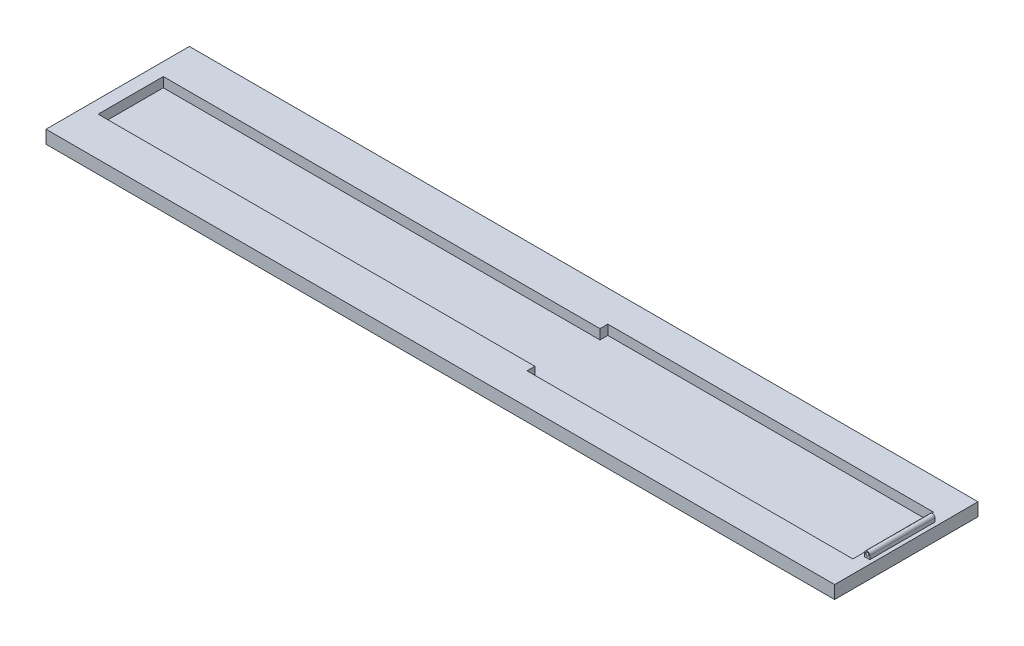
from build123d import *

# Parameters (mm, degrees)
ESQUISSE1_W             = 12100
ESQUISSE1_H             = 200
EXTRUSION1_DEPTH        = 1100
ESQUISSE2_R             = 25
EXTRUSION2_DEPTH        = 500
ENL_V_MAT_EXTRU_1_DEPTH = 150


with BuildPart() as part:
    # Esquisse1 → Extrusion1 (new, symmetric)
    with BuildSketch(Plane.XY):
        with Locations((-5950, -155)):
            Rectangle(ESQUISSE1_W, ESQUISSE1_H)
    extrude(amount=EXTRUSION1_DEPTH, both=True)

    # Esquisse2 → Extrusion2 (add, symmetric)
    with BuildSketch(Plane.XY):
        with BuildLine():
            Line((-40, 0), (-40, -55))
            Line((-40, -55), (40, -55))
            Line((40, -55), (40, 0))
            ThreePointArc((40, 0), (0, 40), (-40, 0))
        make_face()
        Circle(ESQUISSE2_R, mode=Mode.SUBTRACT)
    extrude(amount=EXTRUSION2_DEPTH, both=True)

    # Esquisse3 → Enl_v. mat.-Extru.1 (cut)
    with BuildSketch(Plane(origin=(0, -55, 0), x_dir=(1, 0, 0), z_dir=(0, 1, 0))):
        Polygon((-5100, 620), (-100, 620), (-100, -620), (-5100, -620), (-5100, -500), (-11800, -500), (-11800, 500), (-5100, 500), align=None)
    extrude(amount=-ENL_V_MAT_EXTRU_1_DEPTH, mode=Mode.SUBTRACT)


solid = part.part
